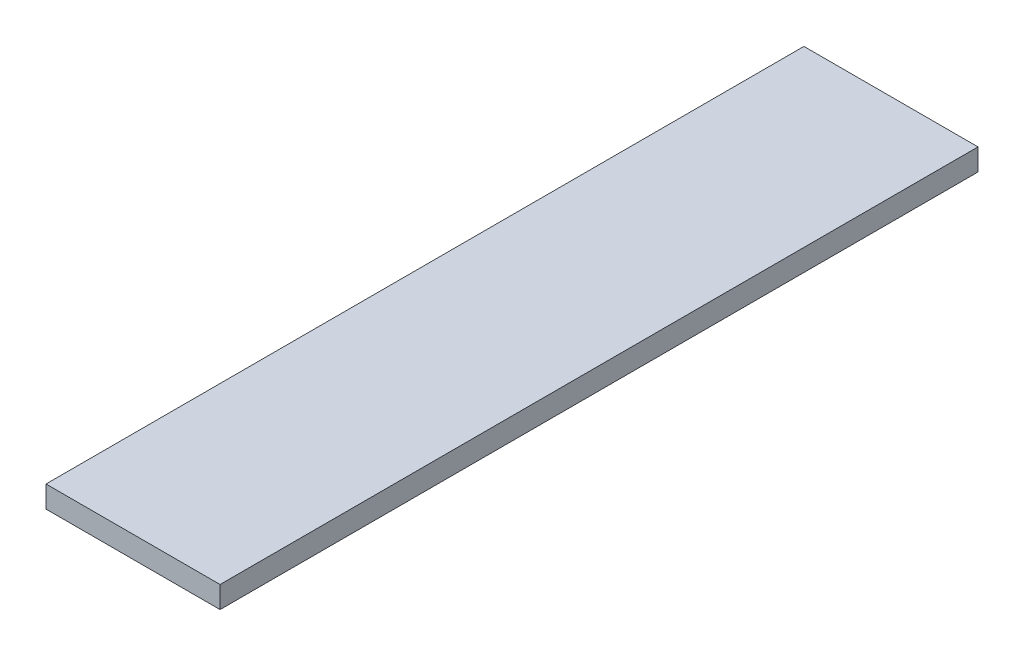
ISO-10303-21;
HEADER;
FILE_DESCRIPTION(('STEP AP214'),'2;1');
FILE_NAME('part.step','',(''),(''),'','','');
FILE_SCHEMA(('AUTOMOTIVE_DESIGN { 1 0 10303 214 1 1 1 1 }'));
ENDSEC;
DATA;
#1=APPLICATION_CONTEXT('core data for automotive mechanical design processes');
#2=APPLICATION_PROTOCOL_DEFINITION('international standard','automotive_design',2000,#1);
#3=PRODUCT_CONTEXT('',#1,'mechanical');
#4=PRODUCT('Part','Part','',(#3));
#5=PRODUCT_RELATED_PRODUCT_CATEGORY('part','',(#4));
#6=PRODUCT_DEFINITION_FORMATION('','',#4);
#7=PRODUCT_DEFINITION_CONTEXT('part definition',#1,'design');
#8=PRODUCT_DEFINITION('design','',#6,#7);
#9=PRODUCT_DEFINITION_SHAPE('','',#8);
#10=(LENGTH_UNIT() NAMED_UNIT(*) SI_UNIT(.MILLI.,.METRE.));
#11=(NAMED_UNIT(*) PLANE_ANGLE_UNIT() SI_UNIT($,.RADIAN.));
#12=(NAMED_UNIT(*) SI_UNIT($,.STERADIAN.) SOLID_ANGLE_UNIT());
#13=UNCERTAINTY_MEASURE_WITH_UNIT(LENGTH_MEASURE(1.E-05),#10,'distance_accuracy_value','');
#14=(GEOMETRIC_REPRESENTATION_CONTEXT(3) GLOBAL_UNCERTAINTY_ASSIGNED_CONTEXT((#13)) GLOBAL_UNIT_ASSIGNED_CONTEXT((#10,
#11,#12)) REPRESENTATION_CONTEXT('',''));
#15=CARTESIAN_POINT('',(0.,0.,0.));
#16=DIRECTION('',(0.,0.,1.));
#17=DIRECTION('',(1.,0.,0.));
#18=AXIS2_PLACEMENT_3D('',#15,#16,#17);
#19=CARTESIAN_POINT('',(38.1,9.525,-165.89375));
#20=DIRECTION('',(-1.,0.,0.));
#21=DIRECTION('',(0.,0.,1.));
#22=AXIS2_PLACEMENT_3D('',#19,#20,#21);
#23=PLANE('',#22);
#24=DIRECTION('',(0.,0.,-1.));
#25=VECTOR('',#24,1.);
#26=CARTESIAN_POINT('',(38.1,0.,-165.89375));
#27=LINE('',#26,#25);
#28=CARTESIAN_POINT('',(38.1,0.,165.89375));
#29=VERTEX_POINT('',#28);
#30=CARTESIAN_POINT('',(38.1,0.,-165.89375));
#31=VERTEX_POINT('',#30);
#32=EDGE_CURVE('E97',#29,#31,#27,.T.);
#33=ORIENTED_EDGE('',*,*,#32,.T.);
#34=DIRECTION('',(0.,-1.,0.));
#35=VECTOR('',#34,1.);
#36=CARTESIAN_POINT('',(38.1,9.525,-165.89375));
#37=LINE('',#36,#35);
#38=CARTESIAN_POINT('',(38.1,9.525,-165.89375));
#39=VERTEX_POINT('',#38);
#40=EDGE_CURVE('E11',#39,#31,#37,.T.);
#41=ORIENTED_EDGE('',*,*,#40,.F.);
#42=DIRECTION('',(0.,0.,-1.));
#43=VECTOR('',#42,1.);
#44=CARTESIAN_POINT('',(38.1,9.525,-165.89375));
#45=LINE('',#44,#43);
#46=CARTESIAN_POINT('',(38.1,9.525,165.89375));
#47=VERTEX_POINT('',#46);
#48=EDGE_CURVE('E85',#47,#39,#45,.T.);
#49=ORIENTED_EDGE('',*,*,#48,.F.);
#50=DIRECTION('',(0.,-1.,0.));
#51=VECTOR('',#50,1.);
#52=CARTESIAN_POINT('',(38.1,9.525,165.89375));
#53=LINE('',#52,#51);
#54=EDGE_CURVE('E93',#47,#29,#53,.T.);
#55=ORIENTED_EDGE('',*,*,#54,.T.);
#56=EDGE_LOOP('',(#33,#41,#49,#55));
#57=FACE_BOUND('',#56,.T.);
#58=ADVANCED_FACE('F34',(#57),#23,.F.);
#59=CARTESIAN_POINT('',(-38.1,9.525,-165.89375));
#60=DIRECTION('',(0.,0.,1.));
#61=DIRECTION('',(1.,0.,0.));
#62=AXIS2_PLACEMENT_3D('',#59,#60,#61);
#63=PLANE('',#62);
#64=DIRECTION('',(-1.,0.,0.));
#65=VECTOR('',#64,1.);
#66=CARTESIAN_POINT('',(-38.1,0.,-165.89375));
#67=LINE('',#66,#65);
#68=CARTESIAN_POINT('',(-38.1,0.,-165.89375));
#69=VERTEX_POINT('',#68);
#70=EDGE_CURVE('E89',#31,#69,#67,.T.);
#71=ORIENTED_EDGE('',*,*,#70,.T.);
#72=DIRECTION('',(0.,-1.,0.));
#73=VECTOR('',#72,1.);
#74=CARTESIAN_POINT('',(-38.1,9.525,-165.89375));
#75=LINE('',#74,#73);
#76=CARTESIAN_POINT('',(-38.1,9.525,-165.89375));
#77=VERTEX_POINT('',#76);
#78=EDGE_CURVE('E42',#77,#69,#75,.T.);
#79=ORIENTED_EDGE('',*,*,#78,.F.);
#80=DIRECTION('',(-1.,0.,0.));
#81=VECTOR('',#80,1.);
#82=CARTESIAN_POINT('',(-38.1,9.525,-165.89375));
#83=LINE('',#82,#81);
#84=EDGE_CURVE('E80',#39,#77,#83,.T.);
#85=ORIENTED_EDGE('',*,*,#84,.F.);
#86=ORIENTED_EDGE('',*,*,#40,.T.);
#87=EDGE_LOOP('',(#71,#79,#85,#86));
#88=FACE_BOUND('',#87,.T.);
#89=ADVANCED_FACE('F88',(#88),#63,.F.);
#90=CARTESIAN_POINT('',(-38.1,9.525,-165.89375));
#91=DIRECTION('',(1.,0.,0.));
#92=DIRECTION('',(0.,0.,-1.));
#93=AXIS2_PLACEMENT_3D('',#90,#91,#92);
#94=PLANE('',#93);
#95=DIRECTION('',(0.,0.,1.));
#96=VECTOR('',#95,1.);
#97=CARTESIAN_POINT('',(-38.1,0.,-165.89375));
#98=LINE('',#97,#96);
#99=CARTESIAN_POINT('',(-38.1,0.,165.89375));
#100=VERTEX_POINT('',#99);
#101=EDGE_CURVE('E67',#69,#100,#98,.T.);
#102=ORIENTED_EDGE('',*,*,#101,.T.);
#103=DIRECTION('',(0.,-1.,0.));
#104=VECTOR('',#103,1.);
#105=CARTESIAN_POINT('',(-38.1,9.525,165.89375));
#106=LINE('',#105,#104);
#107=CARTESIAN_POINT('',(-38.1,9.525,165.89375));
#108=VERTEX_POINT('',#107);
#109=EDGE_CURVE('E90',#108,#100,#106,.T.);
#110=ORIENTED_EDGE('',*,*,#109,.F.);
#111=DIRECTION('',(0.,0.,1.));
#112=VECTOR('',#111,1.);
#113=CARTESIAN_POINT('',(-38.1,9.525,-165.89375));
#114=LINE('',#113,#112);
#115=EDGE_CURVE('E83',#77,#108,#114,.T.);
#116=ORIENTED_EDGE('',*,*,#115,.F.);
#117=ORIENTED_EDGE('',*,*,#78,.T.);
#118=EDGE_LOOP('',(#102,#110,#116,#117));
#119=FACE_BOUND('',#118,.T.);
#120=ADVANCED_FACE('F91',(#119),#94,.F.);
#121=CARTESIAN_POINT('',(-38.1,9.525,165.89375));
#122=DIRECTION('',(0.,0.,-1.));
#123=DIRECTION('',(-1.,0.,0.));
#124=AXIS2_PLACEMENT_3D('',#121,#122,#123);
#125=PLANE('',#124);
#126=DIRECTION('',(1.,0.,0.));
#127=VECTOR('',#126,1.);
#128=CARTESIAN_POINT('',(-38.1,0.,165.89375));
#129=LINE('',#128,#127);
#130=EDGE_CURVE('E73',#100,#29,#129,.T.);
#131=ORIENTED_EDGE('',*,*,#130,.T.);
#132=ORIENTED_EDGE('',*,*,#54,.F.);
#133=DIRECTION('',(1.,0.,0.));
#134=VECTOR('',#133,1.);
#135=CARTESIAN_POINT('',(-38.1,9.525,165.89375));
#136=LINE('',#135,#134);
#137=EDGE_CURVE('E50',#108,#47,#136,.T.);
#138=ORIENTED_EDGE('',*,*,#137,.F.);
#139=ORIENTED_EDGE('',*,*,#109,.T.);
#140=EDGE_LOOP('',(#131,#132,#138,#139));
#141=FACE_BOUND('',#140,.T.);
#142=ADVANCED_FACE('F104',(#141),#125,.F.);
#143=CARTESIAN_POINT('',(0.,9.525,0.));
#144=DIRECTION('',(0.,1.,0.));
#145=DIRECTION('',(0.,0.,1.));
#146=AXIS2_PLACEMENT_3D('',#143,#144,#145);
#147=PLANE('',#146);
#148=ORIENTED_EDGE('',*,*,#48,.T.);
#149=ORIENTED_EDGE('',*,*,#84,.T.);
#150=ORIENTED_EDGE('',*,*,#115,.T.);
#151=ORIENTED_EDGE('',*,*,#137,.T.);
#152=EDGE_LOOP('',(#148,#149,#150,#151));
#153=FACE_BOUND('',#152,.T.);
#154=ADVANCED_FACE('F81',(#153),#147,.T.);
#155=CARTESIAN_POINT('',(0.,0.,0.));
#156=DIRECTION('',(0.,1.,0.));
#157=DIRECTION('',(0.,0.,1.));
#158=AXIS2_PLACEMENT_3D('',#155,#156,#157);
#159=PLANE('',#158);
#160=ORIENTED_EDGE('',*,*,#32,.F.);
#161=ORIENTED_EDGE('',*,*,#130,.F.);
#162=ORIENTED_EDGE('',*,*,#101,.F.);
#163=ORIENTED_EDGE('',*,*,#70,.F.);
#164=EDGE_LOOP('',(#160,#161,#162,#163));
#165=FACE_BOUND('',#164,.T.);
#166=ADVANCED_FACE('F107',(#165),#159,.F.);
#167=CLOSED_SHELL('',(#58,#89,#120,#142,#154,#166));
#168=MANIFOLD_SOLID_BREP('B2',#167);
#169=ADVANCED_BREP_SHAPE_REPRESENTATION('',(#18,#168),#14);
#170=SHAPE_DEFINITION_REPRESENTATION(#9,#169);
ENDSEC;
END-ISO-10303-21;
